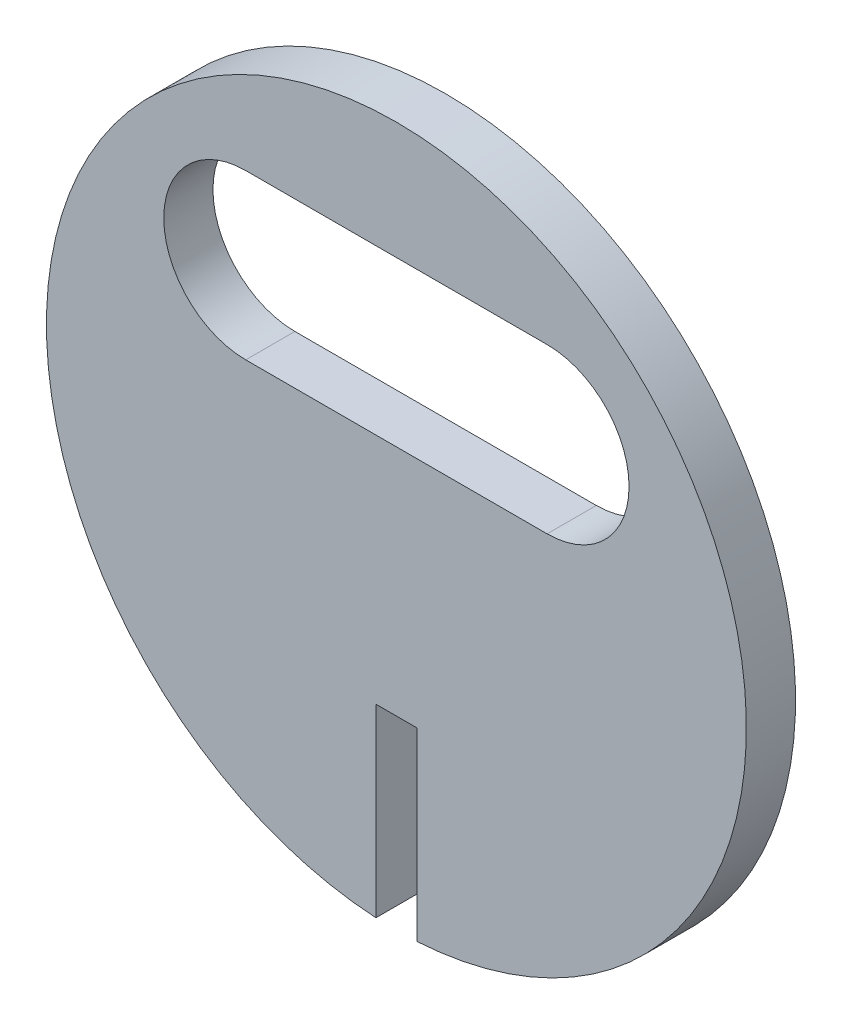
from build123d import *

# Parameters (mm, degrees)
SKETCH1_R          = 27.1145
EXTRUDE1_DEPTH     = 3.81
SKETCH2_W          = 3.175
SKETCH2_H          = 17.097271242
CUT_EXTRUDE1_DEPTH = 39.534508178


with BuildPart() as part:
    # Sketch1 → Extrude1 (new body)
    with BuildSketch(Plane.XY):
        with Locations(Location((0, 0, 0), (0, 0, 180))):
            Circle(SKETCH1_R)
    extrude(amount=EXTRUDE1_DEPTH)

    # Sketch2 → Cut-Extrude1 (cut, through all)
    with BuildSketch(Plane.XY):
        with BuildLine():
            Line((-11.674332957, 18.024332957), (11.674332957, 18.024332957))
            ThreePointArc((11.674332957, 18.024332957), (16.164461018, 16.164461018), (18.024332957, 11.674332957))
            ThreePointArc((18.024332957, 11.674332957), (16.164461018, 7.184204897), (11.674332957, 5.324332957))
            Line((11.674332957, 5.324332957), (-11.674332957, 5.324332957))
            ThreePointArc((-11.674332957, 5.324332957), (-16.164461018, 7.184204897), (-18.024332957, 11.674332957))
            ThreePointArc((-18.024332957, 11.674332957), (-16.164461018, 16.164461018), (-11.674332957, 18.024332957))
        make_face()
        with Locations((0, -21.286735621)):
            Rectangle(SKETCH2_W, SKETCH2_H)
    extrude(amount=CUT_EXTRUDE1_DEPTH, mode=Mode.SUBTRACT)


solid = part.part
